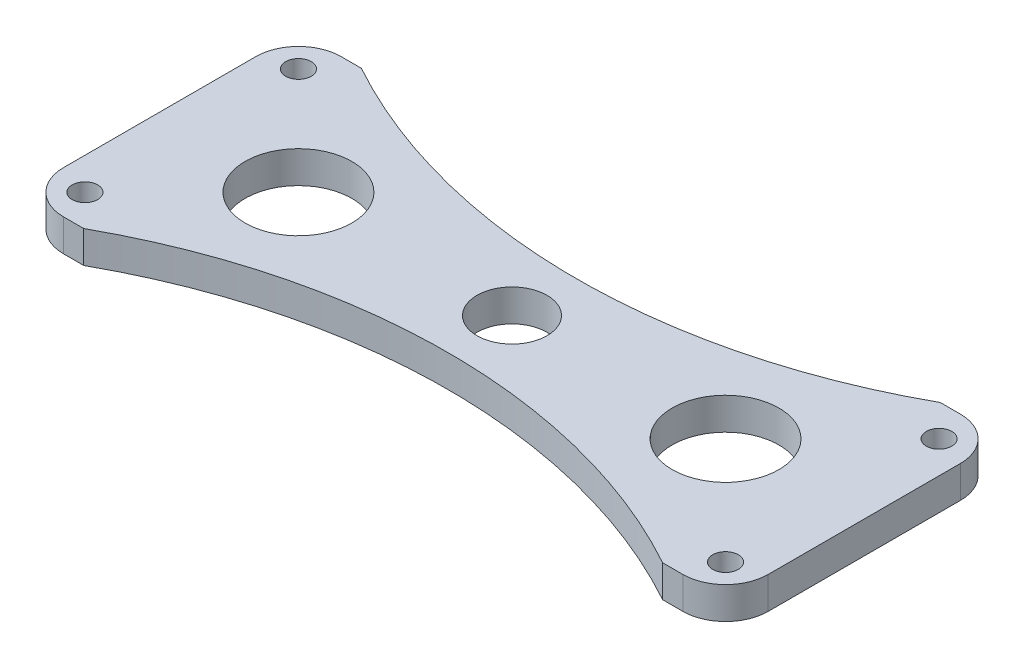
from build123d import *

# Parameters (mm, degrees)
SKETCH1_W             = 104.775
SKETCH1_H             = 41.275
SKETCH1_R             = 5.207
EXTRUDE1_DEPTH        = 4.7625
F_6_CLEARANCE_HOLE1_D = 3.7973
FILLET1_R             = 6.35
SKETCH4_R             = 88.9
SKETCH4_R_2           = 7.9375
CUT_EXTRUDE1_DEPTH    = 57.506972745


with BuildPart() as part:
    # Sketch1 → Extrude1 (new body)
    with BuildSketch(Plane(origin=(0, 0, 0), x_dir=(1, 0, 0), z_dir=(0, 1, 0))):
        Rectangle(SKETCH1_W, SKETCH1_H)
        with Locations(Location((0, 0, 0), (0, 0, 90))):
            Circle(SKETCH1_R, mode=Mode.SUBTRACT)
    extrude(amount=EXTRUDE1_DEPTH)

    # 6 Clearance Hole1 (through all)
    with Locations(Plane(origin=(0, 4.7625, 0), x_dir=(-1, 0, 0), z_dir=(0, 1, 0))):
        with Locations((47.625, -15.875), (47.625, 15.875), (-47.625, -15.875), (-47.625, 15.875)):
            Hole(F_6_CLEARANCE_HOLE1_D / 2)

    # Fillet1
    fillet1_edges = [part.edges().sort_by_distance(p)[0] for p in [
        (-52.3875, 2.38125, -20.6375),
        (52.3875, 2.38125, -20.6375),
        (52.3875, 2.38125, 20.6375),
        (-52.3875, 2.38125, 20.6375),
    ]]
    fillet(fillet1_edges, radius=FILLET1_R)

    # Sketch4 → Cut-Extrude1 (cut, through all)
    with BuildSketch(Plane(origin=(0, 4.7625, 0), x_dir=(-1, 0, 0), z_dir=(0, 1, 0))):
        with Locations((0, 98.425)):
            Circle(SKETCH4_R)
        with Locations((0, -98.425)):
            Circle(SKETCH4_R)
        with Locations(Location((-31.75, 0, 0), (0, 0, 90))):
            Circle(SKETCH4_R_2)
        with Locations(Location((31.75, 0, 0), (0, 0, 90))):
            Circle(SKETCH4_R_2)
    extrude(amount=-CUT_EXTRUDE1_DEPTH, mode=Mode.SUBTRACT)


solid = part.part
